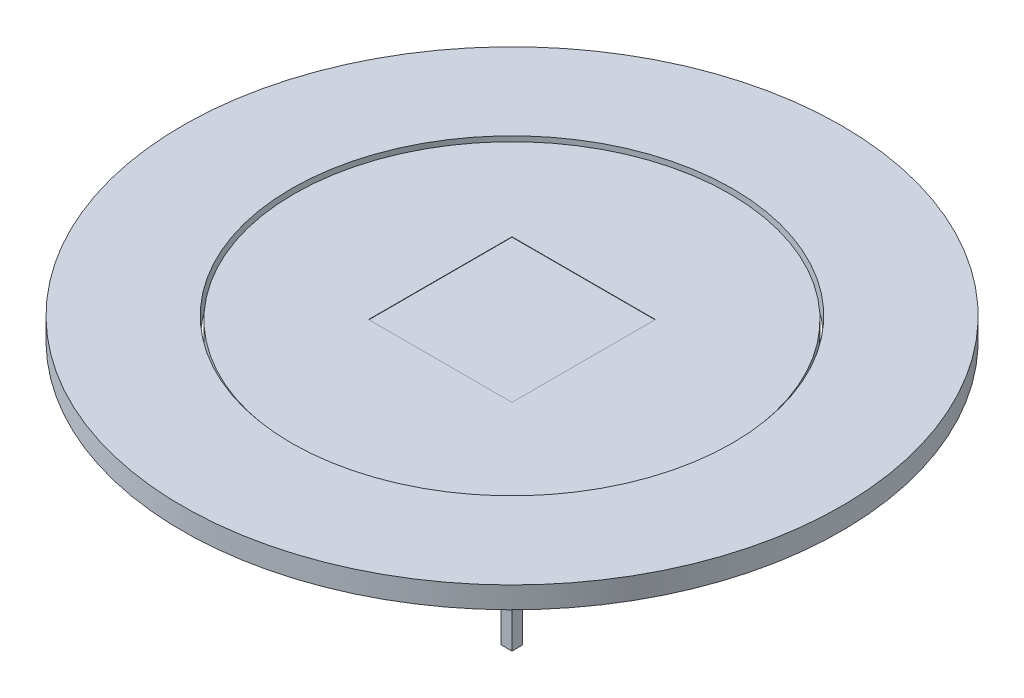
from build123d import *

# Parameters (mm, degrees)
SKETCH1_W           = 40
SKETCH1_H           = 40
BOSS_EXTRUDE1_DEPTH = 5
SKETCH2_W           = 3
SKETCH2_H           = 3
BOSS_EXTRUDE2_DEPTH = 55
BOSS_EXTRUDE7_DEPTH = 2
SKETCH3_W           = 40
SKETCH3_H           = 40
BOSS_EXTRUDE3_DEPTH = 5.1
SKETCH4_W           = 42.015291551
SKETCH4_H           = 3.269672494
BOSS_EXTRUDE4_DEPTH = 2
BOSS_EXTRUDE5_DEPTH = 6
SKETCH6_W           = 32.335596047
SKETCH6_H           = 4
BOSS_EXTRUDE6_DEPTH = 2


with BuildPart() as part:
    # Sketch1 → Boss-Extrude1 (new body)
    with BuildSketch(Plane(origin=(0, 0, 0), x_dir=(1, 0, 0), z_dir=(0, 1, 0))):
        with Locations((20, 20)):
            Rectangle(SKETCH1_W, SKETCH1_H)
    extrude(amount=BOSS_EXTRUDE1_DEPTH)

    # Sketch2 → Boss-Extrude2 (add)
    with BuildSketch(Plane.XZ):
        with Locations((1.5, -1.5)):
            Rectangle(SKETCH2_W, SKETCH2_H)
        with Locations((1.5, -38.5)):
            Rectangle(SKETCH2_W, SKETCH2_H)
        with Locations((38.5, -1.5)):
            Rectangle(SKETCH2_W, SKETCH2_H)
        with Locations((38.5, -38.5)):
            Rectangle(SKETCH2_W, SKETCH2_H)
    extrude(amount=BOSS_EXTRUDE2_DEPTH)

    # Sketch7 → Boss-Extrude7 (add)
    with BuildSketch(Plane.XZ):
        Polygon((21.742641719, 28), (23.791847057, 28), (23.791847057, -2), (15.791847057, -2), (15.791847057, 28), (17.754481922, 28), (17.754481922, 58), (21.742641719, 58), align=None)
        Polygon((11.955339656, -2), (1.524568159, 26.128259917), (-0.083390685, 25.531982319), (-10.514162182, 53.660242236), (-14.264596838, 52.269472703), (-3.833825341, 24.141212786), (-5.976301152, 23.346720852), (4.454470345, -4.781539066), align=None)
        Polygon((26.791847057, -2), (39.124729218, 26.128259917), (40.801960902, 25.392874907), (53.195834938, 53.660242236), (57.428922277, 51.804238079), (45.035048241, 23.53687075), (46.451425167, 22.91585794), (34.118543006, -5.212401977), align=None)
    extrude(amount=BOSS_EXTRUDE7_DEPTH)

    # Sketch3 → Boss-Extrude3 (add)
    with BuildSketch(Plane(origin=(0, 0, 0), x_dir=(1, 0, 0), z_dir=(0, 1, 0))):
        with BuildLine():
            ThreePointArc((62.965542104, 62.965542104), (20, 80.762452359), (-22.965542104, 62.965542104))
            ThreePointArc((-22.965542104, 62.965542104), (-40.762452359, 20), (-22.965542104, -22.965542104))
            ThreePointArc((-22.965542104, -22.965542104), (20, -40.762452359), (62.965542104, -22.965542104))
            ThreePointArc((62.965542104, -22.965542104), (80.762452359, 20), (62.965542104, 62.965542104))
        make_face()
        with Locations((20, 20)):
            Rectangle(SKETCH3_W, SKETCH3_H, mode=Mode.SUBTRACT)
    extrude(amount=BOSS_EXTRUDE3_DEPTH)

    # Sketch4 → Boss-Extrude4 (add)
    with BuildSketch(Plane.XZ):
        Polygon((24.087090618, -21.825809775), (64.794513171, -29.99999101), (63.9611398, -34.150190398), (23.253717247, -25.976009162), align=None)
        with Locations((45.094736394, -17.248268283)):
            Rectangle(SKETCH4_W, SKETCH4_H)
        Polygon((24.087090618, -11.035890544), (62.178775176, 0), (63.300179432, -3.870659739), (25.208494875, -14.906550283), align=None)
    extrude(amount=BOSS_EXTRUDE4_DEPTH)

    # Sketch6 → Boss-Extrude6 (add)
    with BuildSketch(Plane.XZ):
        Polygon((71.733431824, -26.889936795), (102.775934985, -39.069278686), (101.206558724, -43.069278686), (70.164055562, -30.889936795), align=None)
        with Locations((86.608136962, -16.508825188)):
            Rectangle(SKETCH6_W, SKETCH6_H)
    extrude(amount=BOSS_EXTRUDE6_DEPTH)


with BuildPart() as body_2:
    # Sketch5 → Boss-Extrude5 (new body)
    with BuildSketch(Plane.XZ):
        with BuildLine():
            ThreePointArc((111.956843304, -20), (111.170364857, -8.000657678), (108.824386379, 3.79337257))
            ThreePointArc((108.824386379, 3.79337257), (99.635835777, 25.97332197), (85.017856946, 45.017856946))
            ThreePointArc((85.017856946, 45.017856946), (-64.90286579, -55.188885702), (111.956843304, -20))
        make_face()
        with BuildLine():
            ThreePointArc((81.498791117, -20), (-36.817474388, -43.534568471), (63.486212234, 23.486212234))
            ThreePointArc((63.486212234, 23.486212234), (73.261217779, 10.74644678), (79.405032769, -4.089519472))
            ThreePointArc((79.405032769, -4.089519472), (80.973104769, -11.976172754), (81.498791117, -20))
        make_face(mode=Mode.SUBTRACT)
    extrude(amount=-BOSS_EXTRUDE5_DEPTH)


solid = Compound([part.part, body_2.part])
